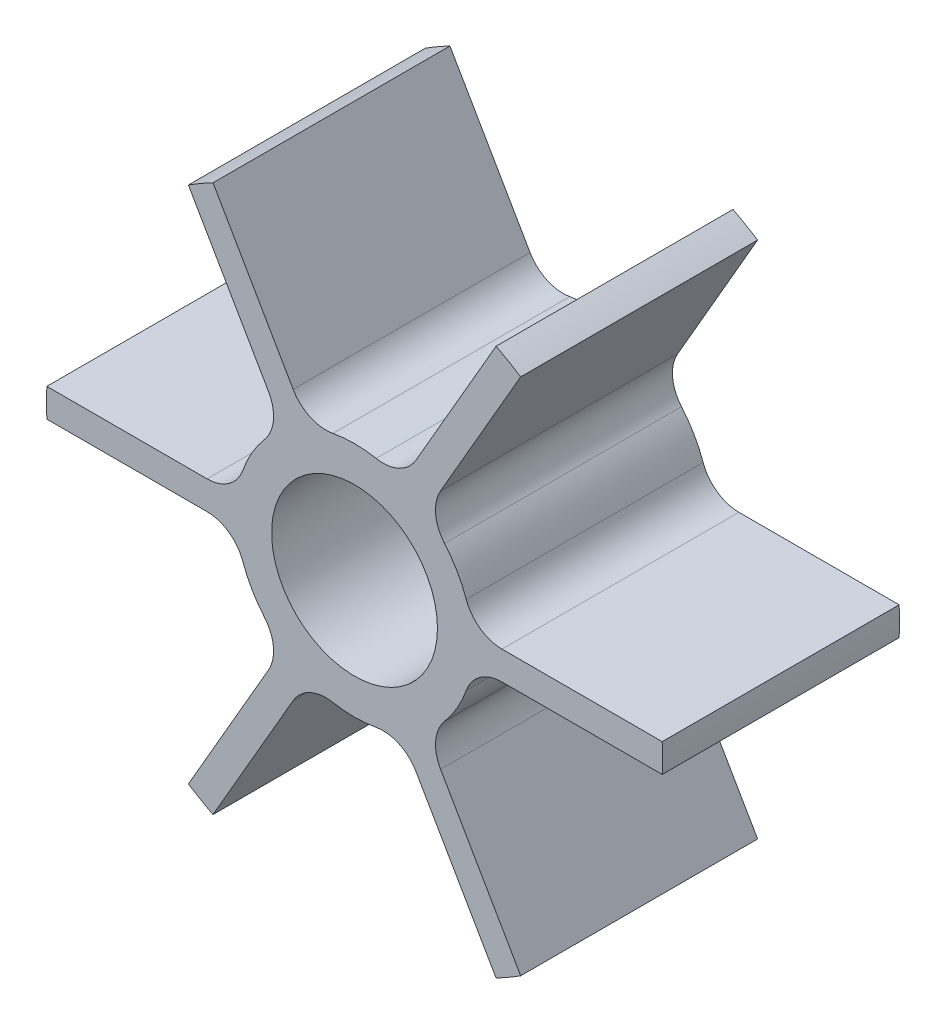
from build123d import *

# Parameters (mm, degrees)
SKETCH1_R                = 25
EXTRUDE1_DEPTH           = 50
SKETCH3_R                = 17.5
CUT_EXTRUDE1_DEPTH       = 62.23724357
RIB_DEPTH                = 50
FILLET1_R                = 8
CIRPATTERN1_COUNT        = 6
FILLET1_OF_CIRPATTERN1_R = 8


with BuildPart() as part:
    # Sketch1 → Extrude1 (new body)
    with BuildSketch(Plane.XY):
        Circle(SKETCH1_R)
    extrude(amount=EXTRUDE1_DEPTH)

    # Sketch3 → Cut-Extrude1 (cut, through all)
    with BuildSketch(Plane.XY.offset(50)):
        Circle(SKETCH3_R)
    extrude(amount=-CUT_EXTRUDE1_DEPTH, mode=Mode.SUBTRACT)

    # rib diameter → rib (add, through all)
    with BuildSketch(Plane.XY.offset(50)):
        with BuildLine():
            Line((24.819347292, 3), (64.930732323, 3))
            ThreePointArc((64.930732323, 3), (65, 0), (64.930732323, -3))
            Line((64.930732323, -3), (24.819347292, -3))
            ThreePointArc((24.819347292, -3), (25, 0), (24.819347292, 3))
        make_face()
    rib = extrude(amount=-RIB_DEPTH)

    # Fillet1
    fillet1_edges = [part.edges().sort_by_distance(p)[0] for p in [
        (24.819347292, -3, 25),
        (24.819347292, 3, 25),
    ]]
    fillet(fillet1_edges, radius=FILLET1_R)

    # CirPattern1: rib ×6 about axis
    cirpattern1_axis = Axis((0, 0, 0), (0, 0, 1))
    for i in range(1, CIRPATTERN1_COUNT):
        add(rib.rotate(cirpattern1_axis, i * 360 / CIRPATTERN1_COUNT))

    # Fillet1 of CirPattern1
    fillet1_of_cirpattern1_edges = [part.edges().sort_by_distance(p)[0] for p in [
        (15.007749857, 19.99418526, 25),
        (9.811597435, 22.99418526, 25),
        (-9.811597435, 22.99418526, 25),
        (-15.007749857, 19.99418526, 25),
        (-24.819347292, 3, 25),
        (-24.819347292, -3, 25),
        (-15.007749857, -19.99418526, 25),
        (-9.811597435, -22.99418526, 25),
        (9.811597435, -22.99418526, 25),
        (15.007749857, -19.99418526, 25),
    ]]
    fillet(fillet1_of_cirpattern1_edges, radius=FILLET1_OF_CIRPATTERN1_R)


solid = part.part
